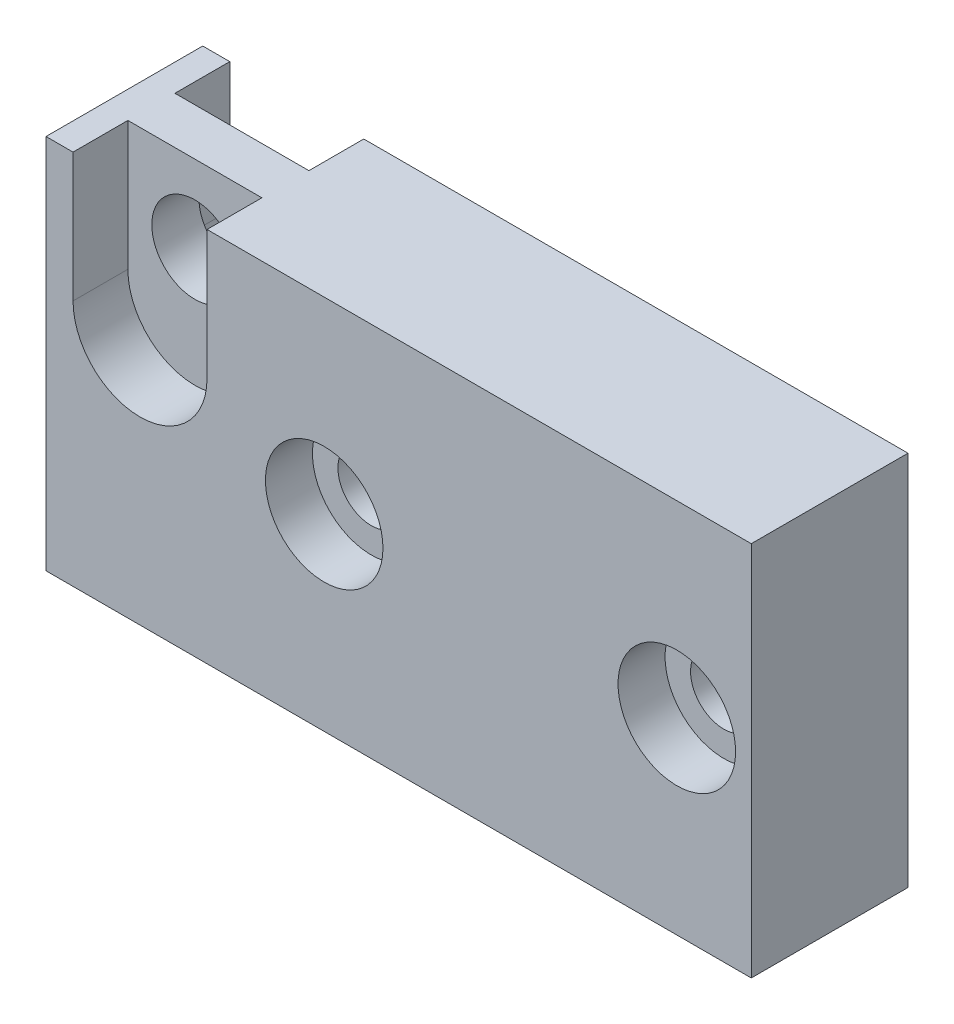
ISO-10303-21;
HEADER;
FILE_DESCRIPTION(('STEP AP214'),'2;1');
FILE_NAME('part.step','',(''),(''),'','','');
FILE_SCHEMA(('AUTOMOTIVE_DESIGN { 1 0 10303 214 1 1 1 1 }'));
ENDSEC;
DATA;
#1=APPLICATION_CONTEXT('core data for automotive mechanical design processes');
#2=APPLICATION_PROTOCOL_DEFINITION('international standard','automotive_design',2000,#1);
#3=PRODUCT_CONTEXT('',#1,'mechanical');
#4=PRODUCT('Part','Part','',(#3));
#5=PRODUCT_RELATED_PRODUCT_CATEGORY('part','',(#4));
#6=PRODUCT_DEFINITION_FORMATION('','',#4);
#7=PRODUCT_DEFINITION_CONTEXT('part definition',#1,'design');
#8=PRODUCT_DEFINITION('design','',#6,#7);
#9=PRODUCT_DEFINITION_SHAPE('','',#8);
#10=(LENGTH_UNIT() NAMED_UNIT(*) SI_UNIT(.MILLI.,.METRE.));
#11=(NAMED_UNIT(*) PLANE_ANGLE_UNIT() SI_UNIT($,.RADIAN.));
#12=(NAMED_UNIT(*) SI_UNIT($,.STERADIAN.) SOLID_ANGLE_UNIT());
#13=UNCERTAINTY_MEASURE_WITH_UNIT(LENGTH_MEASURE(1.E-05),#10,'distance_accuracy_value','');
#14=(GEOMETRIC_REPRESENTATION_CONTEXT(3) GLOBAL_UNCERTAINTY_ASSIGNED_CONTEXT((#13)) GLOBAL_UNIT_ASSIGNED_CONTEXT((#10,
#11,#12)) REPRESENTATION_CONTEXT('',''));
#15=CARTESIAN_POINT('',(0.,0.,0.));
#16=DIRECTION('',(0.,0.,1.));
#17=DIRECTION('',(1.,0.,0.));
#18=AXIS2_PLACEMENT_3D('',#15,#16,#17);
#19=CARTESIAN_POINT('',(0.,0.,-10.));
#20=DIRECTION('',(0.,0.,-1.));
#21=DIRECTION('',(-1.,0.,0.));
#22=AXIS2_PLACEMENT_3D('',#19,#20,#21);
#23=PLANE('',#22);
#24=CARTESIAN_POINT('',(-9.5,0.,-10.));
#25=DIRECTION('',(0.,0.,1.));
#26=DIRECTION('',(1.,0.,0.));
#27=AXIS2_PLACEMENT_3D('',#24,#25,#26);
#28=CIRCLE('',#27,7.5);
#29=CARTESIAN_POINT('',(-17.,0.,-10.));
#30=VERTEX_POINT('',#29);
#31=EDGE_CURVE('E157',#30,#30,#28,.T.);
#32=ORIENTED_EDGE('',*,*,#31,.T.);
#33=EDGE_LOOP('',(#32));
#34=FACE_BOUND('',#33,.T.);
#35=CARTESIAN_POINT('',(35.5,0.,-10.));
#36=DIRECTION('',(0.,0.,1.));
#37=DIRECTION('',(1.,0.,0.));
#38=AXIS2_PLACEMENT_3D('',#35,#36,#37);
#39=CIRCLE('',#38,7.5);
#40=CARTESIAN_POINT('',(28.,0.,-10.));
#41=VERTEX_POINT('',#40);
#42=EDGE_CURVE('E160',#41,#41,#39,.T.);
#43=ORIENTED_EDGE('',*,*,#42,.T.);
#44=EDGE_LOOP('',(#43));
#45=FACE_BOUND('',#44,.T.);
#46=DIRECTION('',(-1.,0.,0.));
#47=VECTOR('',#46,1.);
#48=CARTESIAN_POINT('',(-45.,24.,-10.));
#49=LINE('',#48,#47);
#50=CARTESIAN_POINT('',(-41.55,24.,-10.));
#51=VERTEX_POINT('',#50);
#52=CARTESIAN_POINT('',(-45.,24.,-10.));
#53=VERTEX_POINT('',#52);
#54=EDGE_CURVE('E241',#51,#53,#49,.T.);
#55=ORIENTED_EDGE('',*,*,#54,.F.);
#56=DIRECTION('',(0.,-1.,0.));
#57=VECTOR('',#56,1.);
#58=CARTESIAN_POINT('',(-41.55,0.,-10.));
#59=LINE('',#58,#57);
#60=CARTESIAN_POINT('',(-41.55,7.55,-10.));
#61=VERTEX_POINT('',#60);
#62=EDGE_CURVE('E478',#51,#61,#59,.T.);
#63=ORIENTED_EDGE('',*,*,#62,.T.);
#64=CARTESIAN_POINT('',(-33.,7.55,-10.));
#65=DIRECTION('',(0.,0.,1.));
#66=DIRECTION('',(1.,0.,0.));
#67=AXIS2_PLACEMENT_3D('',#64,#65,#66);
#68=CIRCLE('',#67,8.55);
#69=CARTESIAN_POINT('',(-24.45,7.55,-10.));
#70=VERTEX_POINT('',#69);
#71=EDGE_CURVE('E470',#61,#70,#68,.T.);
#72=ORIENTED_EDGE('',*,*,#71,.T.);
#73=DIRECTION('',(0.,1.,0.));
#74=VECTOR('',#73,1.);
#75=CARTESIAN_POINT('',(-24.45,0.,-10.));
#76=LINE('',#75,#74);
#77=CARTESIAN_POINT('',(-24.45,24.,-10.));
#78=VERTEX_POINT('',#77);
#79=EDGE_CURVE('E474',#70,#78,#76,.T.);
#80=ORIENTED_EDGE('',*,*,#79,.T.);
#81=CARTESIAN_POINT('',(45.,24.,-10.));
#82=VERTEX_POINT('',#81);
#83=EDGE_CURVE('E145',#82,#78,#49,.T.);
#84=ORIENTED_EDGE('',*,*,#83,.F.);
#85=DIRECTION('',(0.,1.,0.));
#86=VECTOR('',#85,1.);
#87=CARTESIAN_POINT('',(45.,24.,-10.));
#88=LINE('',#87,#86);
#89=CARTESIAN_POINT('',(45.,-24.,-10.));
#90=VERTEX_POINT('',#89);
#91=EDGE_CURVE('E238',#90,#82,#88,.T.);
#92=ORIENTED_EDGE('',*,*,#91,.F.);
#93=DIRECTION('',(1.,0.,0.));
#94=VECTOR('',#93,1.);
#95=CARTESIAN_POINT('',(45.,-24.,-10.));
#96=LINE('',#95,#94);
#97=CARTESIAN_POINT('',(-45.,-24.,-10.));
#98=VERTEX_POINT('',#97);
#99=EDGE_CURVE('E235',#98,#90,#96,.T.);
#100=ORIENTED_EDGE('',*,*,#99,.F.);
#101=DIRECTION('',(0.,-1.,0.));
#102=VECTOR('',#101,1.);
#103=CARTESIAN_POINT('',(-45.,-24.,-10.));
#104=LINE('',#103,#102);
#105=EDGE_CURVE('E232',#53,#98,#104,.T.);
#106=ORIENTED_EDGE('',*,*,#105,.F.);
#107=EDGE_LOOP('',(#55,#63,#72,#80,#84,#92,#100,#106));
#108=FACE_BOUND('',#107,.T.);
#109=ADVANCED_FACE('F35',(#34,#45,#108),#23,.T.);
#110=CARTESIAN_POINT('',(-33.,14.,-10.));
#111=DIRECTION('',(0.,0.,1.));
#112=DIRECTION('',(1.,0.,0.));
#113=AXIS2_PLACEMENT_3D('',#110,#111,#112);
#114=CYLINDRICAL_SURFACE('',#113,5.5);
#115=CARTESIAN_POINT('',(-33.,14.,3.));
#116=DIRECTION('',(0.,0.,1.));
#117=DIRECTION('',(1.,0.,0.));
#118=AXIS2_PLACEMENT_3D('',#115,#116,#117);
#119=CIRCLE('',#118,5.5);
#120=CARTESIAN_POINT('',(-27.5,14.,3.));
#121=VERTEX_POINT('',#120);
#122=EDGE_CURVE('E171',#121,#121,#119,.F.);
#123=ORIENTED_EDGE('',*,*,#122,.F.);
#124=EDGE_LOOP('',(#123));
#125=FACE_BOUND('',#124,.T.);
#126=CARTESIAN_POINT('',(-33.,14.,-3.));
#127=DIRECTION('',(0.,0.,1.));
#128=DIRECTION('',(1.,0.,0.));
#129=AXIS2_PLACEMENT_3D('',#126,#127,#128);
#130=CIRCLE('',#129,5.5);
#131=CARTESIAN_POINT('',(-27.5,14.,-3.));
#132=VERTEX_POINT('',#131);
#133=EDGE_CURVE('E468',#132,#132,#130,.F.);
#134=ORIENTED_EDGE('',*,*,#133,.T.);
#135=EDGE_LOOP('',(#134));
#136=FACE_BOUND('',#135,.T.);
#137=ADVANCED_FACE('F289',(#125,#136),#114,.F.);
#138=CARTESIAN_POINT('',(-45.,24.,-10.));
#139=DIRECTION('',(0.,1.,0.));
#140=DIRECTION('',(0.,0.,1.));
#141=AXIS2_PLACEMENT_3D('',#138,#139,#140);
#142=PLANE('',#141);
#143=DIRECTION('',(-1.,0.,0.));
#144=VECTOR('',#143,1.);
#145=CARTESIAN_POINT('',(0.,24.,-3.));
#146=LINE('',#145,#144);
#147=CARTESIAN_POINT('',(-24.45,24.,-3.));
#148=VERTEX_POINT('',#147);
#149=CARTESIAN_POINT('',(-41.55,24.,-3.));
#150=VERTEX_POINT('',#149);
#151=EDGE_CURVE('E135',#148,#150,#146,.T.);
#152=ORIENTED_EDGE('',*,*,#151,.T.);
#153=DIRECTION('',(0.,0.,-1.));
#154=VECTOR('',#153,1.);
#155=CARTESIAN_POINT('',(-41.55,24.,-3.));
#156=LINE('',#155,#154);
#157=EDGE_CURVE('E146',#150,#51,#156,.T.);
#158=ORIENTED_EDGE('',*,*,#157,.T.);
#159=ORIENTED_EDGE('',*,*,#54,.T.);
#160=DIRECTION('',(0.,0.,1.));
#161=VECTOR('',#160,1.);
#162=CARTESIAN_POINT('',(-45.,24.,-10.));
#163=LINE('',#162,#161);
#164=CARTESIAN_POINT('',(-45.,24.,10.));
#165=VERTEX_POINT('',#164);
#166=EDGE_CURVE('E11',#53,#165,#163,.T.);
#167=ORIENTED_EDGE('',*,*,#166,.T.);
#168=DIRECTION('',(-1.,0.,0.));
#169=VECTOR('',#168,1.);
#170=CARTESIAN_POINT('',(-45.,24.,10.));
#171=LINE('',#170,#169);
#172=CARTESIAN_POINT('',(-41.55,24.,10.));
#173=VERTEX_POINT('',#172);
#174=EDGE_CURVE('E228',#173,#165,#171,.T.);
#175=ORIENTED_EDGE('',*,*,#174,.F.);
#176=DIRECTION('',(0.,0.,1.));
#177=VECTOR('',#176,1.);
#178=CARTESIAN_POINT('',(-41.55,24.,3.));
#179=LINE('',#178,#177);
#180=CARTESIAN_POINT('',(-41.55,24.,3.));
#181=VERTEX_POINT('',#180);
#182=EDGE_CURVE('E193',#181,#173,#179,.T.);
#183=ORIENTED_EDGE('',*,*,#182,.F.);
#184=DIRECTION('',(-1.,0.,0.));
#185=VECTOR('',#184,1.);
#186=CARTESIAN_POINT('',(0.,24.,3.));
#187=LINE('',#186,#185);
#188=CARTESIAN_POINT('',(-24.45,24.,3.));
#189=VERTEX_POINT('',#188);
#190=EDGE_CURVE('E184',#189,#181,#187,.T.);
#191=ORIENTED_EDGE('',*,*,#190,.F.);
#192=DIRECTION('',(0.,0.,1.));
#193=VECTOR('',#192,1.);
#194=CARTESIAN_POINT('',(-24.45,24.,3.));
#195=LINE('',#194,#193);
#196=CARTESIAN_POINT('',(-24.45,24.,10.));
#197=VERTEX_POINT('',#196);
#198=EDGE_CURVE('E196',#189,#197,#195,.T.);
#199=ORIENTED_EDGE('',*,*,#198,.T.);
#200=CARTESIAN_POINT('',(45.,24.,10.));
#201=VERTEX_POINT('',#200);
#202=EDGE_CURVE('E229',#201,#197,#171,.T.);
#203=ORIENTED_EDGE('',*,*,#202,.F.);
#204=DIRECTION('',(0.,0.,1.));
#205=VECTOR('',#204,1.);
#206=CARTESIAN_POINT('',(45.,24.,-10.));
#207=LINE('',#206,#205);
#208=EDGE_CURVE('E44',#82,#201,#207,.T.);
#209=ORIENTED_EDGE('',*,*,#208,.F.);
#210=ORIENTED_EDGE('',*,*,#83,.T.);
#211=DIRECTION('',(0.,0.,-1.));
#212=VECTOR('',#211,1.);
#213=CARTESIAN_POINT('',(-24.45,24.,-3.));
#214=LINE('',#213,#212);
#215=EDGE_CURVE('E131',#148,#78,#214,.T.);
#216=ORIENTED_EDGE('',*,*,#215,.F.);
#217=EDGE_LOOP('',(#152,#158,#159,#167,#175,#183,#191,#199,#203,#209,#210,#216));
#218=FACE_BOUND('',#217,.T.);
#219=ADVANCED_FACE('F143',(#218),#142,.T.);
#220=CARTESIAN_POINT('',(-9.5,0.,-10.));
#221=DIRECTION('',(0.,0.,1.));
#222=DIRECTION('',(1.,0.,0.));
#223=AXIS2_PLACEMENT_3D('',#220,#221,#222);
#224=CYLINDRICAL_SURFACE('',#223,4.25);
#225=CARTESIAN_POINT('',(-9.5,0.,4.));
#226=DIRECTION('',(0.,0.,1.));
#227=DIRECTION('',(1.,0.,0.));
#228=AXIS2_PLACEMENT_3D('',#225,#226,#227);
#229=CIRCLE('',#228,4.25);
#230=CARTESIAN_POINT('',(-5.25,0.,4.));
#231=VERTEX_POINT('',#230);
#232=EDGE_CURVE('E202',#231,#231,#229,.F.);
#233=ORIENTED_EDGE('',*,*,#232,.F.);
#234=EDGE_LOOP('',(#233));
#235=FACE_BOUND('',#234,.T.);
#236=CARTESIAN_POINT('',(-9.5,0.,-4.));
#237=DIRECTION('',(0.,0.,1.));
#238=DIRECTION('',(1.,0.,0.));
#239=AXIS2_PLACEMENT_3D('',#236,#237,#238);
#240=CIRCLE('',#239,4.25);
#241=CARTESIAN_POINT('',(-5.25,0.,-4.));
#242=VERTEX_POINT('',#241);
#243=EDGE_CURVE('E153',#242,#242,#240,.F.);
#244=ORIENTED_EDGE('',*,*,#243,.T.);
#245=EDGE_LOOP('',(#244));
#246=FACE_BOUND('',#245,.T.);
#247=ADVANCED_FACE('F303',(#235,#246),#224,.F.);
#248=CARTESIAN_POINT('',(35.5,0.,-10.));
#249=DIRECTION('',(0.,0.,1.));
#250=DIRECTION('',(1.,0.,0.));
#251=AXIS2_PLACEMENT_3D('',#248,#249,#250);
#252=CYLINDRICAL_SURFACE('',#251,4.25);
#253=CARTESIAN_POINT('',(35.5,0.,4.));
#254=DIRECTION('',(0.,0.,1.));
#255=DIRECTION('',(1.,0.,0.));
#256=AXIS2_PLACEMENT_3D('',#253,#254,#255);
#257=CIRCLE('',#256,4.25);
#258=CARTESIAN_POINT('',(39.75,0.,4.));
#259=VERTEX_POINT('',#258);
#260=EDGE_CURVE('E211',#259,#259,#257,.F.);
#261=ORIENTED_EDGE('',*,*,#260,.F.);
#262=EDGE_LOOP('',(#261));
#263=FACE_BOUND('',#262,.T.);
#264=CARTESIAN_POINT('',(35.5,0.,-4.));
#265=DIRECTION('',(0.,0.,1.));
#266=DIRECTION('',(1.,0.,0.));
#267=AXIS2_PLACEMENT_3D('',#264,#265,#266);
#268=CIRCLE('',#267,4.25);
#269=CARTESIAN_POINT('',(39.75,0.,-4.));
#270=VERTEX_POINT('',#269);
#271=EDGE_CURVE('E163',#270,#270,#268,.F.);
#272=ORIENTED_EDGE('',*,*,#271,.T.);
#273=EDGE_LOOP('',(#272));
#274=FACE_BOUND('',#273,.T.);
#275=ADVANCED_FACE('F333',(#263,#274),#252,.F.);
#276=CARTESIAN_POINT('',(-45.,-24.,-10.));
#277=DIRECTION('',(-1.,0.,0.));
#278=DIRECTION('',(0.,0.,1.));
#279=AXIS2_PLACEMENT_3D('',#276,#277,#278);
#280=PLANE('',#279);
#281=DIRECTION('',(0.,0.,1.));
#282=VECTOR('',#281,1.);
#283=CARTESIAN_POINT('',(-45.,-24.,-10.));
#284=LINE('',#283,#282);
#285=CARTESIAN_POINT('',(-45.,-24.,10.));
#286=VERTEX_POINT('',#285);
#287=EDGE_CURVE('E39',#98,#286,#284,.T.);
#288=ORIENTED_EDGE('',*,*,#287,.T.);
#289=DIRECTION('',(0.,-1.,0.));
#290=VECTOR('',#289,1.);
#291=CARTESIAN_POINT('',(-45.,-24.,10.));
#292=LINE('',#291,#290);
#293=EDGE_CURVE('E217',#165,#286,#292,.T.);
#294=ORIENTED_EDGE('',*,*,#293,.F.);
#295=ORIENTED_EDGE('',*,*,#166,.F.);
#296=ORIENTED_EDGE('',*,*,#105,.T.);
#297=EDGE_LOOP('',(#288,#294,#295,#296));
#298=FACE_BOUND('',#297,.T.);
#299=ADVANCED_FACE('F37',(#298),#280,.T.);
#300=CARTESIAN_POINT('',(45.,24.,-10.));
#301=DIRECTION('',(1.,0.,0.));
#302=DIRECTION('',(0.,0.,-1.));
#303=AXIS2_PLACEMENT_3D('',#300,#301,#302);
#304=PLANE('',#303);
#305=ORIENTED_EDGE('',*,*,#208,.T.);
#306=DIRECTION('',(0.,1.,0.));
#307=VECTOR('',#306,1.);
#308=CARTESIAN_POINT('',(45.,24.,10.));
#309=LINE('',#308,#307);
#310=CARTESIAN_POINT('',(45.,-24.,10.));
#311=VERTEX_POINT('',#310);
#312=EDGE_CURVE('E225',#311,#201,#309,.T.);
#313=ORIENTED_EDGE('',*,*,#312,.F.);
#314=DIRECTION('',(0.,0.,1.));
#315=VECTOR('',#314,1.);
#316=CARTESIAN_POINT('',(45.,-24.,-10.));
#317=LINE('',#316,#315);
#318=EDGE_CURVE('E243',#90,#311,#317,.T.);
#319=ORIENTED_EDGE('',*,*,#318,.F.);
#320=ORIENTED_EDGE('',*,*,#91,.T.);
#321=EDGE_LOOP('',(#305,#313,#319,#320));
#322=FACE_BOUND('',#321,.T.);
#323=ADVANCED_FACE('F263',(#322),#304,.T.);
#324=CARTESIAN_POINT('',(45.,-24.,-10.));
#325=DIRECTION('',(0.,-1.,0.));
#326=DIRECTION('',(0.,0.,-1.));
#327=AXIS2_PLACEMENT_3D('',#324,#325,#326);
#328=PLANE('',#327);
#329=ORIENTED_EDGE('',*,*,#318,.T.);
#330=DIRECTION('',(1.,0.,0.));
#331=VECTOR('',#330,1.);
#332=CARTESIAN_POINT('',(45.,-24.,10.));
#333=LINE('',#332,#331);
#334=EDGE_CURVE('E222',#286,#311,#333,.T.);
#335=ORIENTED_EDGE('',*,*,#334,.F.);
#336=ORIENTED_EDGE('',*,*,#287,.F.);
#337=ORIENTED_EDGE('',*,*,#99,.T.);
#338=EDGE_LOOP('',(#329,#335,#336,#337));
#339=FACE_BOUND('',#338,.T.);
#340=ADVANCED_FACE('F251',(#339),#328,.T.);
#341=CARTESIAN_POINT('',(0.,0.,10.));
#342=DIRECTION('',(0.,0.,-1.));
#343=DIRECTION('',(-1.,0.,0.));
#344=AXIS2_PLACEMENT_3D('',#341,#342,#343);
#345=PLANE('',#344);
#346=CARTESIAN_POINT('',(-9.5,0.,10.));
#347=DIRECTION('',(0.,0.,1.));
#348=DIRECTION('',(1.,0.,0.));
#349=AXIS2_PLACEMENT_3D('',#346,#347,#348);
#350=CIRCLE('',#349,7.5);
#351=CARTESIAN_POINT('',(-2.,0.,10.));
#352=VERTEX_POINT('',#351);
#353=EDGE_CURVE('E195',#352,#352,#350,.T.);
#354=ORIENTED_EDGE('',*,*,#353,.F.);
#355=EDGE_LOOP('',(#354));
#356=FACE_BOUND('',#355,.T.);
#357=CARTESIAN_POINT('',(35.5,0.,10.));
#358=DIRECTION('',(0.,0.,1.));
#359=DIRECTION('',(1.,0.,0.));
#360=AXIS2_PLACEMENT_3D('',#357,#358,#359);
#361=CIRCLE('',#360,7.5);
#362=CARTESIAN_POINT('',(43.,0.,10.));
#363=VERTEX_POINT('',#362);
#364=EDGE_CURVE('E208',#363,#363,#361,.T.);
#365=ORIENTED_EDGE('',*,*,#364,.F.);
#366=EDGE_LOOP('',(#365));
#367=FACE_BOUND('',#366,.T.);
#368=CARTESIAN_POINT('',(-33.,7.55,10.));
#369=DIRECTION('',(0.,0.,1.));
#370=DIRECTION('',(1.,0.,0.));
#371=AXIS2_PLACEMENT_3D('',#368,#369,#370);
#372=CIRCLE('',#371,8.55);
#373=CARTESIAN_POINT('',(-41.55,7.55,10.));
#374=VERTEX_POINT('',#373);
#375=CARTESIAN_POINT('',(-24.45,7.55,10.));
#376=VERTEX_POINT('',#375);
#377=EDGE_CURVE('E189',#374,#376,#372,.T.);
#378=ORIENTED_EDGE('',*,*,#377,.F.);
#379=DIRECTION('',(0.,-1.,0.));
#380=VECTOR('',#379,1.);
#381=CARTESIAN_POINT('',(-41.55,0.,10.));
#382=LINE('',#381,#380);
#383=EDGE_CURVE('E60',#173,#374,#382,.T.);
#384=ORIENTED_EDGE('',*,*,#383,.F.);
#385=ORIENTED_EDGE('',*,*,#174,.T.);
#386=ORIENTED_EDGE('',*,*,#293,.T.);
#387=ORIENTED_EDGE('',*,*,#334,.T.);
#388=ORIENTED_EDGE('',*,*,#312,.T.);
#389=ORIENTED_EDGE('',*,*,#202,.T.);
#390=DIRECTION('',(0.,1.,0.));
#391=VECTOR('',#390,1.);
#392=CARTESIAN_POINT('',(-24.45,0.,10.));
#393=LINE('',#392,#391);
#394=EDGE_CURVE('E175',#376,#197,#393,.T.);
#395=ORIENTED_EDGE('',*,*,#394,.F.);
#396=EDGE_LOOP('',(#378,#384,#385,#386,#387,#388,#389,#395));
#397=FACE_BOUND('',#396,.T.);
#398=ADVANCED_FACE('F255',(#356,#367,#397),#345,.F.);
#399=CARTESIAN_POINT('',(35.5,0.,4.));
#400=DIRECTION('',(0.,0.,1.));
#401=DIRECTION('',(1.,0.,0.));
#402=AXIS2_PLACEMENT_3D('',#399,#400,#401);
#403=CYLINDRICAL_SURFACE('',#402,7.5);
#404=CARTESIAN_POINT('',(35.5,0.,4.));
#405=DIRECTION('',(0.,0.,1.));
#406=DIRECTION('',(1.,0.,0.));
#407=AXIS2_PLACEMENT_3D('',#404,#405,#406);
#408=CIRCLE('',#407,7.5);
#409=CARTESIAN_POINT('',(43.,0.,4.));
#410=VERTEX_POINT('',#409);
#411=EDGE_CURVE('E214',#410,#410,#408,.T.);
#412=CARTESIAN_POINT('',(43.,0.,4.));
#413=CARTESIAN_POINT('',(43.,0.,4.0625));
#414=CARTESIAN_POINT('',(43.,0.,4.125));
#415=CARTESIAN_POINT('',(43.,0.,4.25));
#416=CARTESIAN_POINT('',(43.,0.,4.3125));
#417=CARTESIAN_POINT('',(43.,0.,4.4375));
#418=CARTESIAN_POINT('',(43.,0.,4.5));
#419=CARTESIAN_POINT('',(43.,0.,4.625));
#420=CARTESIAN_POINT('',(43.,0.,4.6875));
#421=CARTESIAN_POINT('',(43.,0.,4.8125));
#422=CARTESIAN_POINT('',(43.,0.,4.875));
#423=CARTESIAN_POINT('',(43.,0.,5.));
#424=CARTESIAN_POINT('',(43.,0.,5.0625));
#425=CARTESIAN_POINT('',(43.,0.,5.1875));
#426=CARTESIAN_POINT('',(43.,0.,5.25));
#427=CARTESIAN_POINT('',(43.,0.,5.375));
#428=CARTESIAN_POINT('',(43.,0.,5.4375));
#429=CARTESIAN_POINT('',(43.,0.,5.5625));
#430=CARTESIAN_POINT('',(43.,0.,5.625));
#431=CARTESIAN_POINT('',(43.,0.,5.75));
#432=CARTESIAN_POINT('',(43.,0.,5.8125));
#433=CARTESIAN_POINT('',(43.,0.,5.9375));
#434=CARTESIAN_POINT('',(43.,0.,6.));
#435=CARTESIAN_POINT('',(43.,0.,6.125));
#436=CARTESIAN_POINT('',(43.,0.,6.1875));
#437=CARTESIAN_POINT('',(43.,0.,6.3125));
#438=CARTESIAN_POINT('',(43.,0.,6.375));
#439=CARTESIAN_POINT('',(43.,0.,6.5));
#440=CARTESIAN_POINT('',(43.,0.,6.5625));
#441=CARTESIAN_POINT('',(43.,0.,6.6875));
#442=CARTESIAN_POINT('',(43.,0.,6.75));
#443=CARTESIAN_POINT('',(43.,0.,6.875));
#444=CARTESIAN_POINT('',(43.,0.,6.9375));
#445=CARTESIAN_POINT('',(43.,0.,7.0625));
#446=CARTESIAN_POINT('',(43.,0.,7.125));
#447=CARTESIAN_POINT('',(43.,0.,7.25));
#448=CARTESIAN_POINT('',(43.,0.,7.3125));
#449=CARTESIAN_POINT('',(43.,0.,7.4375));
#450=CARTESIAN_POINT('',(43.,0.,7.5));
#451=CARTESIAN_POINT('',(43.,0.,7.625));
#452=CARTESIAN_POINT('',(43.,0.,7.6875));
#453=CARTESIAN_POINT('',(43.,0.,7.8125));
#454=CARTESIAN_POINT('',(43.,0.,7.875));
#455=CARTESIAN_POINT('',(43.,0.,8.));
#456=CARTESIAN_POINT('',(43.,0.,8.0625));
#457=CARTESIAN_POINT('',(43.,0.,8.1875));
#458=CARTESIAN_POINT('',(43.,0.,8.25));
#459=CARTESIAN_POINT('',(43.,0.,8.375));
#460=CARTESIAN_POINT('',(43.,0.,8.4375));
#461=CARTESIAN_POINT('',(43.,0.,8.5625));
#462=CARTESIAN_POINT('',(43.,0.,8.625));
#463=CARTESIAN_POINT('',(43.,0.,8.75));
#464=CARTESIAN_POINT('',(43.,0.,8.8125));
#465=CARTESIAN_POINT('',(43.,0.,8.9375));
#466=CARTESIAN_POINT('',(43.,0.,9.));
#467=CARTESIAN_POINT('',(43.,0.,9.125));
#468=CARTESIAN_POINT('',(43.,0.,9.1875));
#469=CARTESIAN_POINT('',(43.,0.,9.3125));
#470=CARTESIAN_POINT('',(43.,0.,9.375));
#471=CARTESIAN_POINT('',(43.,0.,9.5));
#472=CARTESIAN_POINT('',(43.,0.,9.5625));
#473=CARTESIAN_POINT('',(43.,0.,9.6875));
#474=CARTESIAN_POINT('',(43.,0.,9.75));
#475=CARTESIAN_POINT('',(43.,0.,9.875));
#476=CARTESIAN_POINT('',(43.,0.,9.9375));
#477=CARTESIAN_POINT('',(43.,0.,10.));
#478=B_SPLINE_CURVE_WITH_KNOTS('',3,(#412,#413,#414,#415,#416,#417,#418,#419,#420,#421,#422,
#423,#424,#425,#426,#427,#428,#429,#430,#431,#432,#433,#434,#435,#436,#437,#438,#439,#440,#441,
#442,#443,#444,#445,#446,#447,#448,#449,#450,#451,#452,#453,#454,#455,#456,#457,#458,#459,#460,
#461,#462,#463,#464,#465,#466,#467,#468,#469,#470,#471,#472,#473,#474,#475,#476,#477),
.UNSPECIFIED.,.F.,.F.,(4,2,2,2,2,2,2,2,2,2,2,2,2,2,2,2,2,2,2,2,2,2,2,2,2,2,2,2,2,2,2,2,4),(0.,
0.1875,0.375,0.5625,0.750000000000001,0.937500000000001,1.125,1.3125,1.5,1.6875,1.875,2.0625,
2.25,2.4375,2.625,2.8125,3.,3.1875,3.375,3.5625,3.75,3.9375,4.125,4.3125,4.5,4.6875,4.875,
5.0625,5.25,5.4375,5.625,5.8125,6.),.UNSPECIFIED.);
#479=EDGE_CURVE('BSEAM309',#410,#363,#478,.T.);
#480=ORIENTED_EDGE('',*,*,#411,.F.);
#481=ORIENTED_EDGE('',*,*,#364,.T.);
#482=ORIENTED_EDGE('',*,*,#479,.T.);
#483=ORIENTED_EDGE('',*,*,#479,.F.);
#484=EDGE_LOOP('',(#480,#482,#481,#483));
#485=FACE_BOUND('',#484,.T.);
#486=ADVANCED_FACE('F309',(#485),#403,.F.);
#487=CARTESIAN_POINT('',(0.,0.,4.));
#488=DIRECTION('',(0.,0.,1.));
#489=DIRECTION('',(1.,0.,0.));
#490=AXIS2_PLACEMENT_3D('',#487,#488,#489);
#491=PLANE('',#490);
#492=ORIENTED_EDGE('',*,*,#260,.T.);
#493=EDGE_LOOP('',(#492));
#494=FACE_BOUND('',#493,.T.);
#495=ORIENTED_EDGE('',*,*,#411,.T.);
#496=EDGE_LOOP('',(#495));
#497=FACE_BOUND('',#496,.T.);
#498=ADVANCED_FACE('F314',(#494,#497),#491,.T.);
#499=CARTESIAN_POINT('',(-9.5,0.,4.));
#500=DIRECTION('',(0.,0.,1.));
#501=DIRECTION('',(1.,0.,0.));
#502=AXIS2_PLACEMENT_3D('',#499,#500,#501);
#503=CYLINDRICAL_SURFACE('',#502,7.5);
#504=CARTESIAN_POINT('',(-9.5,0.,4.));
#505=DIRECTION('',(0.,0.,1.));
#506=DIRECTION('',(1.,0.,0.));
#507=AXIS2_PLACEMENT_3D('',#504,#505,#506);
#508=CIRCLE('',#507,7.5);
#509=CARTESIAN_POINT('',(-2.,0.,4.));
#510=VERTEX_POINT('',#509);
#511=EDGE_CURVE('E205',#510,#510,#508,.T.);
#512=CARTESIAN_POINT('',(-2.,0.,4.));
#513=CARTESIAN_POINT('',(-2.,0.,4.0625));
#514=CARTESIAN_POINT('',(-2.,0.,4.125));
#515=CARTESIAN_POINT('',(-2.,0.,4.25));
#516=CARTESIAN_POINT('',(-2.,0.,4.3125));
#517=CARTESIAN_POINT('',(-2.,0.,4.4375));
#518=CARTESIAN_POINT('',(-2.,0.,4.5));
#519=CARTESIAN_POINT('',(-2.,0.,4.625));
#520=CARTESIAN_POINT('',(-2.,0.,4.6875));
#521=CARTESIAN_POINT('',(-2.,0.,4.8125));
#522=CARTESIAN_POINT('',(-2.,0.,4.875));
#523=CARTESIAN_POINT('',(-2.,0.,5.));
#524=CARTESIAN_POINT('',(-2.,0.,5.0625));
#525=CARTESIAN_POINT('',(-2.,0.,5.1875));
#526=CARTESIAN_POINT('',(-2.,0.,5.25));
#527=CARTESIAN_POINT('',(-2.,0.,5.375));
#528=CARTESIAN_POINT('',(-2.,0.,5.4375));
#529=CARTESIAN_POINT('',(-2.,0.,5.5625));
#530=CARTESIAN_POINT('',(-2.,0.,5.625));
#531=CARTESIAN_POINT('',(-2.,0.,5.75));
#532=CARTESIAN_POINT('',(-2.,0.,5.8125));
#533=CARTESIAN_POINT('',(-2.,0.,5.9375));
#534=CARTESIAN_POINT('',(-2.,0.,6.));
#535=CARTESIAN_POINT('',(-2.,0.,6.125));
#536=CARTESIAN_POINT('',(-2.,0.,6.1875));
#537=CARTESIAN_POINT('',(-2.,0.,6.3125));
#538=CARTESIAN_POINT('',(-2.,0.,6.375));
#539=CARTESIAN_POINT('',(-2.,0.,6.5));
#540=CARTESIAN_POINT('',(-2.,0.,6.5625));
#541=CARTESIAN_POINT('',(-2.,0.,6.6875));
#542=CARTESIAN_POINT('',(-2.,0.,6.75));
#543=CARTESIAN_POINT('',(-2.,0.,6.875));
#544=CARTESIAN_POINT('',(-2.,0.,6.9375));
#545=CARTESIAN_POINT('',(-2.,0.,7.0625));
#546=CARTESIAN_POINT('',(-2.,0.,7.125));
#547=CARTESIAN_POINT('',(-2.,0.,7.25));
#548=CARTESIAN_POINT('',(-2.,0.,7.3125));
#549=CARTESIAN_POINT('',(-2.,0.,7.4375));
#550=CARTESIAN_POINT('',(-2.,0.,7.5));
#551=CARTESIAN_POINT('',(-2.,0.,7.625));
#552=CARTESIAN_POINT('',(-2.,0.,7.6875));
#553=CARTESIAN_POINT('',(-2.,0.,7.8125));
#554=CARTESIAN_POINT('',(-2.,0.,7.875));
#555=CARTESIAN_POINT('',(-2.,0.,8.));
#556=CARTESIAN_POINT('',(-2.,0.,8.0625));
#557=CARTESIAN_POINT('',(-2.,0.,8.1875));
#558=CARTESIAN_POINT('',(-2.,0.,8.25));
#559=CARTESIAN_POINT('',(-2.,0.,8.375));
#560=CARTESIAN_POINT('',(-2.,0.,8.4375));
#561=CARTESIAN_POINT('',(-2.,0.,8.5625));
#562=CARTESIAN_POINT('',(-2.,0.,8.625));
#563=CARTESIAN_POINT('',(-2.,0.,8.75));
#564=CARTESIAN_POINT('',(-2.,0.,8.8125));
#565=CARTESIAN_POINT('',(-2.,0.,8.9375));
#566=CARTESIAN_POINT('',(-2.,0.,9.));
#567=CARTESIAN_POINT('',(-2.,0.,9.125));
#568=CARTESIAN_POINT('',(-2.,0.,9.1875));
#569=CARTESIAN_POINT('',(-2.,0.,9.3125));
#570=CARTESIAN_POINT('',(-2.,0.,9.375));
#571=CARTESIAN_POINT('',(-2.,0.,9.5));
#572=CARTESIAN_POINT('',(-2.,0.,9.5625));
#573=CARTESIAN_POINT('',(-2.,0.,9.6875));
#574=CARTESIAN_POINT('',(-2.,0.,9.75));
#575=CARTESIAN_POINT('',(-2.,0.,9.875));
#576=CARTESIAN_POINT('',(-2.,0.,9.9375));
#577=CARTESIAN_POINT('',(-2.,0.,10.));
#578=B_SPLINE_CURVE_WITH_KNOTS('',3,(#512,#513,#514,#515,#516,#517,#518,#519,#520,#521,#522,
#523,#524,#525,#526,#527,#528,#529,#530,#531,#532,#533,#534,#535,#536,#537,#538,#539,#540,#541,
#542,#543,#544,#545,#546,#547,#548,#549,#550,#551,#552,#553,#554,#555,#556,#557,#558,#559,#560,
#561,#562,#563,#564,#565,#566,#567,#568,#569,#570,#571,#572,#573,#574,#575,#576,#577),
.UNSPECIFIED.,.F.,.F.,(4,2,2,2,2,2,2,2,2,2,2,2,2,2,2,2,2,2,2,2,2,2,2,2,2,2,2,2,2,2,2,2,4),(0.,
0.1875,0.375,0.5625,0.750000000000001,0.937500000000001,1.125,1.3125,1.5,1.6875,1.875,2.0625,
2.25,2.4375,2.625,2.8125,3.,3.1875,3.375,3.5625,3.75,3.9375,4.125,4.3125,4.5,4.6875,4.875,
5.0625,5.25,5.4375,5.625,5.8125,6.),.UNSPECIFIED.);
#579=EDGE_CURVE('BSEAM284',#510,#352,#578,.T.);
#580=ORIENTED_EDGE('',*,*,#511,.F.);
#581=ORIENTED_EDGE('',*,*,#353,.T.);
#582=ORIENTED_EDGE('',*,*,#579,.T.);
#583=ORIENTED_EDGE('',*,*,#579,.F.);
#584=EDGE_LOOP('',(#580,#582,#581,#583));
#585=FACE_BOUND('',#584,.T.);
#586=ADVANCED_FACE('F284',(#585),#503,.F.);
#587=CARTESIAN_POINT('',(0.,0.,4.));
#588=DIRECTION('',(0.,0.,1.));
#589=DIRECTION('',(1.,0.,0.));
#590=AXIS2_PLACEMENT_3D('',#587,#588,#589);
#591=PLANE('',#590);
#592=ORIENTED_EDGE('',*,*,#232,.T.);
#593=EDGE_LOOP('',(#592));
#594=FACE_BOUND('',#593,.T.);
#595=ORIENTED_EDGE('',*,*,#511,.T.);
#596=EDGE_LOOP('',(#595));
#597=FACE_BOUND('',#596,.T.);
#598=ADVANCED_FACE('F277',(#594,#597),#591,.T.);
#599=CARTESIAN_POINT('',(-41.55,0.,3.));
#600=DIRECTION('',(-1.,0.,0.));
#601=DIRECTION('',(0.,-1.,0.));
#602=AXIS2_PLACEMENT_3D('',#599,#600,#601);
#603=PLANE('',#602);
#604=ORIENTED_EDGE('',*,*,#383,.T.);
#605=DIRECTION('',(0.,0.,1.));
#606=VECTOR('',#605,1.);
#607=CARTESIAN_POINT('',(-41.55,7.55,3.));
#608=LINE('',#607,#606);
#609=CARTESIAN_POINT('',(-41.55,7.55,3.));
#610=VERTEX_POINT('',#609);
#611=EDGE_CURVE('E187',#610,#374,#608,.T.);
#612=ORIENTED_EDGE('',*,*,#611,.F.);
#613=DIRECTION('',(0.,-1.,0.));
#614=VECTOR('',#613,1.);
#615=CARTESIAN_POINT('',(-41.55,0.,3.));
#616=LINE('',#615,#614);
#617=EDGE_CURVE('E174',#181,#610,#616,.T.);
#618=ORIENTED_EDGE('',*,*,#617,.F.);
#619=ORIENTED_EDGE('',*,*,#182,.T.);
#620=EDGE_LOOP('',(#604,#612,#618,#619));
#621=FACE_BOUND('',#620,.T.);
#622=ADVANCED_FACE('F275',(#621),#603,.F.);
#623=CARTESIAN_POINT('',(-24.45,0.,3.));
#624=DIRECTION('',(1.,0.,0.));
#625=DIRECTION('',(0.,0.,-1.));
#626=AXIS2_PLACEMENT_3D('',#623,#624,#625);
#627=PLANE('',#626);
#628=ORIENTED_EDGE('',*,*,#394,.T.);
#629=ORIENTED_EDGE('',*,*,#198,.F.);
#630=DIRECTION('',(0.,1.,0.));
#631=VECTOR('',#630,1.);
#632=CARTESIAN_POINT('',(-24.45,0.,3.));
#633=LINE('',#632,#631);
#634=CARTESIAN_POINT('',(-24.45,7.55,3.));
#635=VERTEX_POINT('',#634);
#636=EDGE_CURVE('E181',#635,#189,#633,.T.);
#637=ORIENTED_EDGE('',*,*,#636,.F.);
#638=DIRECTION('',(0.,0.,1.));
#639=VECTOR('',#638,1.);
#640=CARTESIAN_POINT('',(-24.45,7.55,3.));
#641=LINE('',#640,#639);
#642=EDGE_CURVE('E199',#635,#376,#641,.T.);
#643=ORIENTED_EDGE('',*,*,#642,.T.);
#644=EDGE_LOOP('',(#628,#629,#637,#643));
#645=FACE_BOUND('',#644,.T.);
#646=ADVANCED_FACE('F269',(#645),#627,.F.);
#647=CARTESIAN_POINT('',(-33.,7.55,3.));
#648=DIRECTION('',(0.,0.,1.));
#649=DIRECTION('',(1.,0.,0.));
#650=AXIS2_PLACEMENT_3D('',#647,#648,#649);
#651=CYLINDRICAL_SURFACE('',#650,8.55);
#652=ORIENTED_EDGE('',*,*,#377,.T.);
#653=ORIENTED_EDGE('',*,*,#642,.F.);
#654=CARTESIAN_POINT('',(-33.,7.55,3.));
#655=DIRECTION('',(0.,0.,1.));
#656=DIRECTION('',(1.,0.,0.));
#657=AXIS2_PLACEMENT_3D('',#654,#655,#656);
#658=CIRCLE('',#657,8.55);
#659=EDGE_CURVE('E178',#610,#635,#658,.T.);
#660=ORIENTED_EDGE('',*,*,#659,.F.);
#661=ORIENTED_EDGE('',*,*,#611,.T.);
#662=EDGE_LOOP('',(#652,#653,#660,#661));
#663=FACE_BOUND('',#662,.T.);
#664=ADVANCED_FACE('F274',(#663),#651,.F.);
#665=CARTESIAN_POINT('',(0.,0.,3.));
#666=DIRECTION('',(0.,0.,1.));
#667=DIRECTION('',(1.,0.,0.));
#668=AXIS2_PLACEMENT_3D('',#665,#666,#667);
#669=PLANE('',#668);
#670=ORIENTED_EDGE('',*,*,#122,.T.);
#671=EDGE_LOOP('',(#670));
#672=FACE_BOUND('',#671,.T.);
#673=ORIENTED_EDGE('',*,*,#617,.T.);
#674=ORIENTED_EDGE('',*,*,#659,.T.);
#675=ORIENTED_EDGE('',*,*,#636,.T.);
#676=ORIENTED_EDGE('',*,*,#190,.T.);
#677=EDGE_LOOP('',(#673,#674,#675,#676));
#678=FACE_BOUND('',#677,.T.);
#679=ADVANCED_FACE('F271',(#672,#678),#669,.T.);
#680=CARTESIAN_POINT('',(35.5,0.,-4.));
#681=DIRECTION('',(0.,0.,-1.));
#682=DIRECTION('',(-1.,0.,0.));
#683=AXIS2_PLACEMENT_3D('',#680,#681,#682);
#684=CYLINDRICAL_SURFACE('',#683,7.5);
#685=CARTESIAN_POINT('',(35.5,0.,-4.));
#686=DIRECTION('',(0.,0.,1.));
#687=DIRECTION('',(1.,0.,0.));
#688=AXIS2_PLACEMENT_3D('',#685,#686,#687);
#689=CIRCLE('',#688,7.5);
#690=CARTESIAN_POINT('',(28.,0.,-4.));
#691=VERTEX_POINT('',#690);
#692=EDGE_CURVE('E166',#691,#691,#689,.T.);
#693=CARTESIAN_POINT('',(28.,0.,-4.));
#694=CARTESIAN_POINT('',(28.,0.,-4.0625));
#695=CARTESIAN_POINT('',(28.,0.,-4.125));
#696=CARTESIAN_POINT('',(28.,0.,-4.25));
#697=CARTESIAN_POINT('',(28.,0.,-4.3125));
#698=CARTESIAN_POINT('',(28.,0.,-4.4375));
#699=CARTESIAN_POINT('',(28.,0.,-4.5));
#700=CARTESIAN_POINT('',(28.,0.,-4.625));
#701=CARTESIAN_POINT('',(28.,0.,-4.6875));
#702=CARTESIAN_POINT('',(28.,0.,-4.8125));
#703=CARTESIAN_POINT('',(28.,0.,-4.875));
#704=CARTESIAN_POINT('',(28.,0.,-5.));
#705=CARTESIAN_POINT('',(28.,0.,-5.0625));
#706=CARTESIAN_POINT('',(28.,0.,-5.1875));
#707=CARTESIAN_POINT('',(28.,0.,-5.25));
#708=CARTESIAN_POINT('',(28.,0.,-5.375));
#709=CARTESIAN_POINT('',(28.,0.,-5.4375));
#710=CARTESIAN_POINT('',(28.,0.,-5.5625));
#711=CARTESIAN_POINT('',(28.,0.,-5.625));
#712=CARTESIAN_POINT('',(28.,0.,-5.75));
#713=CARTESIAN_POINT('',(28.,0.,-5.8125));
#714=CARTESIAN_POINT('',(28.,0.,-5.9375));
#715=CARTESIAN_POINT('',(28.,0.,-6.));
#716=CARTESIAN_POINT('',(28.,0.,-6.125));
#717=CARTESIAN_POINT('',(28.,0.,-6.1875));
#718=CARTESIAN_POINT('',(28.,0.,-6.3125));
#719=CARTESIAN_POINT('',(28.,0.,-6.375));
#720=CARTESIAN_POINT('',(28.,0.,-6.5));
#721=CARTESIAN_POINT('',(28.,0.,-6.5625));
#722=CARTESIAN_POINT('',(28.,0.,-6.6875));
#723=CARTESIAN_POINT('',(28.,0.,-6.75));
#724=CARTESIAN_POINT('',(28.,0.,-6.875));
#725=CARTESIAN_POINT('',(28.,0.,-6.9375));
#726=CARTESIAN_POINT('',(28.,0.,-7.0625));
#727=CARTESIAN_POINT('',(28.,0.,-7.125));
#728=CARTESIAN_POINT('',(28.,0.,-7.25));
#729=CARTESIAN_POINT('',(28.,0.,-7.3125));
#730=CARTESIAN_POINT('',(28.,0.,-7.4375));
#731=CARTESIAN_POINT('',(28.,0.,-7.5));
#732=CARTESIAN_POINT('',(28.,0.,-7.625));
#733=CARTESIAN_POINT('',(28.,0.,-7.6875));
#734=CARTESIAN_POINT('',(28.,0.,-7.8125));
#735=CARTESIAN_POINT('',(28.,0.,-7.875));
#736=CARTESIAN_POINT('',(28.,0.,-8.));
#737=CARTESIAN_POINT('',(28.,0.,-8.0625));
#738=CARTESIAN_POINT('',(28.,0.,-8.1875));
#739=CARTESIAN_POINT('',(28.,0.,-8.25));
#740=CARTESIAN_POINT('',(28.,0.,-8.375));
#741=CARTESIAN_POINT('',(28.,0.,-8.4375));
#742=CARTESIAN_POINT('',(28.,0.,-8.5625));
#743=CARTESIAN_POINT('',(28.,0.,-8.625));
#744=CARTESIAN_POINT('',(28.,0.,-8.75));
#745=CARTESIAN_POINT('',(28.,0.,-8.8125));
#746=CARTESIAN_POINT('',(28.,0.,-8.9375));
#747=CARTESIAN_POINT('',(28.,0.,-9.));
#748=CARTESIAN_POINT('',(28.,0.,-9.125));
#749=CARTESIAN_POINT('',(28.,0.,-9.1875));
#750=CARTESIAN_POINT('',(28.,0.,-9.3125));
#751=CARTESIAN_POINT('',(28.,0.,-9.375));
#752=CARTESIAN_POINT('',(28.,0.,-9.5));
#753=CARTESIAN_POINT('',(28.,0.,-9.5625));
#754=CARTESIAN_POINT('',(28.,0.,-9.6875));
#755=CARTESIAN_POINT('',(28.,0.,-9.75));
#756=CARTESIAN_POINT('',(28.,0.,-9.875));
#757=CARTESIAN_POINT('',(28.,0.,-9.9375));
#758=CARTESIAN_POINT('',(28.,0.,-10.));
#759=B_SPLINE_CURVE_WITH_KNOTS('',3,(#693,#694,#695,#696,#697,#698,#699,#700,#701,#702,#703,
#704,#705,#706,#707,#708,#709,#710,#711,#712,#713,#714,#715,#716,#717,#718,#719,#720,#721,#722,
#723,#724,#725,#726,#727,#728,#729,#730,#731,#732,#733,#734,#735,#736,#737,#738,#739,#740,#741,
#742,#743,#744,#745,#746,#747,#748,#749,#750,#751,#752,#753,#754,#755,#756,#757,#758),
.UNSPECIFIED.,.F.,.F.,(4,2,2,2,2,2,2,2,2,2,2,2,2,2,2,2,2,2,2,2,2,2,2,2,2,2,2,2,2,2,2,2,4),(0.,
0.187499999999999,0.374999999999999,0.5625,0.75,0.9375,1.125,1.3125,1.5,1.6875,1.875,2.0625,
2.25,2.4375,2.625,2.8125,3.,3.1875,3.375,3.5625,3.75,3.9375,4.125,4.3125,4.5,4.6875,4.875,
5.0625,5.25,5.4375,5.625,5.8125,6.),.UNSPECIFIED.);
#760=EDGE_CURVE('BSEAM348',#691,#41,#759,.T.);
#761=ORIENTED_EDGE('',*,*,#692,.T.);
#762=ORIENTED_EDGE('',*,*,#42,.F.);
#763=ORIENTED_EDGE('',*,*,#760,.T.);
#764=ORIENTED_EDGE('',*,*,#760,.F.);
#765=EDGE_LOOP('',(#761,#763,#762,#764));
#766=FACE_BOUND('',#765,.T.);
#767=ADVANCED_FACE('F348',(#766),#684,.F.);
#768=CARTESIAN_POINT('',(0.,0.,-4.));
#769=DIRECTION('',(0.,0.,-1.));
#770=DIRECTION('',(1.,0.,0.));
#771=AXIS2_PLACEMENT_3D('',#768,#769,#770);
#772=PLANE('',#771);
#773=ORIENTED_EDGE('',*,*,#271,.F.);
#774=EDGE_LOOP('',(#773));
#775=FACE_BOUND('',#774,.T.);
#776=ORIENTED_EDGE('',*,*,#692,.F.);
#777=EDGE_LOOP('',(#776));
#778=FACE_BOUND('',#777,.T.);
#779=ADVANCED_FACE('F344',(#775,#778),#772,.T.);
#780=CARTESIAN_POINT('',(-9.5,0.,-4.));
#781=DIRECTION('',(0.,0.,-1.));
#782=DIRECTION('',(-1.,0.,0.));
#783=AXIS2_PLACEMENT_3D('',#780,#781,#782);
#784=CYLINDRICAL_SURFACE('',#783,7.5);
#785=CARTESIAN_POINT('',(-9.5,0.,-4.));
#786=DIRECTION('',(0.,0.,1.));
#787=DIRECTION('',(1.,0.,0.));
#788=AXIS2_PLACEMENT_3D('',#785,#786,#787);
#789=CIRCLE('',#788,7.5);
#790=CARTESIAN_POINT('',(-17.,0.,-4.));
#791=VERTEX_POINT('',#790);
#792=EDGE_CURVE('E156',#791,#791,#789,.T.);
#793=CARTESIAN_POINT('',(-17.,0.,-4.));
#794=CARTESIAN_POINT('',(-17.,0.,-4.0625));
#795=CARTESIAN_POINT('',(-17.,0.,-4.125));
#796=CARTESIAN_POINT('',(-17.,0.,-4.25));
#797=CARTESIAN_POINT('',(-17.,0.,-4.3125));
#798=CARTESIAN_POINT('',(-17.,0.,-4.4375));
#799=CARTESIAN_POINT('',(-17.,0.,-4.5));
#800=CARTESIAN_POINT('',(-17.,0.,-4.625));
#801=CARTESIAN_POINT('',(-17.,0.,-4.6875));
#802=CARTESIAN_POINT('',(-17.,0.,-4.8125));
#803=CARTESIAN_POINT('',(-17.,0.,-4.875));
#804=CARTESIAN_POINT('',(-17.,0.,-5.));
#805=CARTESIAN_POINT('',(-17.,0.,-5.0625));
#806=CARTESIAN_POINT('',(-17.,0.,-5.1875));
#807=CARTESIAN_POINT('',(-17.,0.,-5.25));
#808=CARTESIAN_POINT('',(-17.,0.,-5.375));
#809=CARTESIAN_POINT('',(-17.,0.,-5.4375));
#810=CARTESIAN_POINT('',(-17.,0.,-5.5625));
#811=CARTESIAN_POINT('',(-17.,0.,-5.625));
#812=CARTESIAN_POINT('',(-17.,0.,-5.75));
#813=CARTESIAN_POINT('',(-17.,0.,-5.8125));
#814=CARTESIAN_POINT('',(-17.,0.,-5.9375));
#815=CARTESIAN_POINT('',(-17.,0.,-6.));
#816=CARTESIAN_POINT('',(-17.,0.,-6.125));
#817=CARTESIAN_POINT('',(-17.,0.,-6.1875));
#818=CARTESIAN_POINT('',(-17.,0.,-6.3125));
#819=CARTESIAN_POINT('',(-17.,0.,-6.375));
#820=CARTESIAN_POINT('',(-17.,0.,-6.5));
#821=CARTESIAN_POINT('',(-17.,0.,-6.5625));
#822=CARTESIAN_POINT('',(-17.,0.,-6.6875));
#823=CARTESIAN_POINT('',(-17.,0.,-6.75));
#824=CARTESIAN_POINT('',(-17.,0.,-6.875));
#825=CARTESIAN_POINT('',(-17.,0.,-6.9375));
#826=CARTESIAN_POINT('',(-17.,0.,-7.0625));
#827=CARTESIAN_POINT('',(-17.,0.,-7.125));
#828=CARTESIAN_POINT('',(-17.,0.,-7.25));
#829=CARTESIAN_POINT('',(-17.,0.,-7.3125));
#830=CARTESIAN_POINT('',(-17.,0.,-7.4375));
#831=CARTESIAN_POINT('',(-17.,0.,-7.5));
#832=CARTESIAN_POINT('',(-17.,0.,-7.625));
#833=CARTESIAN_POINT('',(-17.,0.,-7.6875));
#834=CARTESIAN_POINT('',(-17.,0.,-7.8125));
#835=CARTESIAN_POINT('',(-17.,0.,-7.875));
#836=CARTESIAN_POINT('',(-17.,0.,-8.));
#837=CARTESIAN_POINT('',(-17.,0.,-8.0625));
#838=CARTESIAN_POINT('',(-17.,0.,-8.1875));
#839=CARTESIAN_POINT('',(-17.,0.,-8.25));
#840=CARTESIAN_POINT('',(-17.,0.,-8.375));
#841=CARTESIAN_POINT('',(-17.,0.,-8.4375));
#842=CARTESIAN_POINT('',(-17.,0.,-8.5625));
#843=CARTESIAN_POINT('',(-17.,0.,-8.625));
#844=CARTESIAN_POINT('',(-17.,0.,-8.75));
#845=CARTESIAN_POINT('',(-17.,0.,-8.8125));
#846=CARTESIAN_POINT('',(-17.,0.,-8.9375));
#847=CARTESIAN_POINT('',(-17.,0.,-9.));
#848=CARTESIAN_POINT('',(-17.,0.,-9.125));
#849=CARTESIAN_POINT('',(-17.,0.,-9.1875));
#850=CARTESIAN_POINT('',(-17.,0.,-9.3125));
#851=CARTESIAN_POINT('',(-17.,0.,-9.375));
#852=CARTESIAN_POINT('',(-17.,0.,-9.5));
#853=CARTESIAN_POINT('',(-17.,0.,-9.5625));
#854=CARTESIAN_POINT('',(-17.,0.,-9.6875));
#855=CARTESIAN_POINT('',(-17.,0.,-9.75));
#856=CARTESIAN_POINT('',(-17.,0.,-9.875));
#857=CARTESIAN_POINT('',(-17.,0.,-9.9375));
#858=CARTESIAN_POINT('',(-17.,0.,-10.));
#859=B_SPLINE_CURVE_WITH_KNOTS('',3,(#793,#794,#795,#796,#797,#798,#799,#800,#801,#802,#803,
#804,#805,#806,#807,#808,#809,#810,#811,#812,#813,#814,#815,#816,#817,#818,#819,#820,#821,#822,
#823,#824,#825,#826,#827,#828,#829,#830,#831,#832,#833,#834,#835,#836,#837,#838,#839,#840,#841,
#842,#843,#844,#845,#846,#847,#848,#849,#850,#851,#852,#853,#854,#855,#856,#857,#858),
.UNSPECIFIED.,.F.,.F.,(4,2,2,2,2,2,2,2,2,2,2,2,2,2,2,2,2,2,2,2,2,2,2,2,2,2,2,2,2,2,2,2,4),(0.,
0.187499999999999,0.374999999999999,0.5625,0.75,0.9375,1.125,1.3125,1.5,1.6875,1.875,2.0625,
2.25,2.4375,2.625,2.8125,3.,3.1875,3.375,3.5625,3.75,3.9375,4.125,4.3125,4.5,4.6875,4.875,
5.0625,5.25,5.4375,5.625,5.8125,6.),.UNSPECIFIED.);
#860=EDGE_CURVE('BSEAM347',#791,#30,#859,.T.);
#861=ORIENTED_EDGE('',*,*,#792,.T.);
#862=ORIENTED_EDGE('',*,*,#31,.F.);
#863=ORIENTED_EDGE('',*,*,#860,.T.);
#864=ORIENTED_EDGE('',*,*,#860,.F.);
#865=EDGE_LOOP('',(#861,#863,#862,#864));
#866=FACE_BOUND('',#865,.T.);
#867=ADVANCED_FACE('F347',(#866),#784,.F.);
#868=CARTESIAN_POINT('',(0.,0.,-4.));
#869=DIRECTION('',(0.,0.,-1.));
#870=DIRECTION('',(1.,0.,0.));
#871=AXIS2_PLACEMENT_3D('',#868,#869,#870);
#872=PLANE('',#871);
#873=ORIENTED_EDGE('',*,*,#243,.F.);
#874=EDGE_LOOP('',(#873));
#875=FACE_BOUND('',#874,.T.);
#876=ORIENTED_EDGE('',*,*,#792,.F.);
#877=EDGE_LOOP('',(#876));
#878=FACE_BOUND('',#877,.T.);
#879=ADVANCED_FACE('F418',(#875,#878),#872,.T.);
#880=CARTESIAN_POINT('',(-41.55,0.,-3.));
#881=DIRECTION('',(1.,0.,0.));
#882=DIRECTION('',(0.,1.,0.));
#883=AXIS2_PLACEMENT_3D('',#880,#881,#882);
#884=PLANE('',#883);
#885=ORIENTED_EDGE('',*,*,#62,.F.);
#886=ORIENTED_EDGE('',*,*,#157,.F.);
#887=DIRECTION('',(0.,-1.,0.));
#888=VECTOR('',#887,1.);
#889=CARTESIAN_POINT('',(-41.55,0.,-3.));
#890=LINE('',#889,#888);
#891=CARTESIAN_POINT('',(-41.55,7.55,-3.));
#892=VERTEX_POINT('',#891);
#893=EDGE_CURVE('E52',#150,#892,#890,.T.);
#894=ORIENTED_EDGE('',*,*,#893,.T.);
#895=DIRECTION('',(0.,0.,-1.));
#896=VECTOR('',#895,1.);
#897=CARTESIAN_POINT('',(-41.55,7.55,-3.));
#898=LINE('',#897,#896);
#899=EDGE_CURVE('E148',#892,#61,#898,.T.);
#900=ORIENTED_EDGE('',*,*,#899,.T.);
#901=EDGE_LOOP('',(#885,#886,#894,#900));
#902=FACE_BOUND('',#901,.T.);
#903=ADVANCED_FACE('F426',(#902),#884,.T.);
#904=CARTESIAN_POINT('',(-33.,7.55,-3.));
#905=DIRECTION('',(0.,0.,-1.));
#906=DIRECTION('',(-1.,0.,0.));
#907=AXIS2_PLACEMENT_3D('',#904,#905,#906);
#908=CYLINDRICAL_SURFACE('',#907,8.55);
#909=ORIENTED_EDGE('',*,*,#71,.F.);
#910=ORIENTED_EDGE('',*,*,#899,.F.);
#911=CARTESIAN_POINT('',(-33.,7.55,-3.));
#912=DIRECTION('',(0.,0.,1.));
#913=DIRECTION('',(1.,0.,0.));
#914=AXIS2_PLACEMENT_3D('',#911,#912,#913);
#915=CIRCLE('',#914,8.55);
#916=CARTESIAN_POINT('',(-24.45,7.55,-3.));
#917=VERTEX_POINT('',#916);
#918=EDGE_CURVE('E134',#892,#917,#915,.T.);
#919=ORIENTED_EDGE('',*,*,#918,.T.);
#920=DIRECTION('',(0.,0.,-1.));
#921=VECTOR('',#920,1.);
#922=CARTESIAN_POINT('',(-24.45,7.55,-3.));
#923=LINE('',#922,#921);
#924=EDGE_CURVE('E133',#917,#70,#923,.T.);
#925=ORIENTED_EDGE('',*,*,#924,.T.);
#926=EDGE_LOOP('',(#909,#910,#919,#925));
#927=FACE_BOUND('',#926,.T.);
#928=ADVANCED_FACE('F435',(#927),#908,.F.);
#929=CARTESIAN_POINT('',(-24.45,0.,-3.));
#930=DIRECTION('',(-1.,0.,0.));
#931=DIRECTION('',(0.,0.,1.));
#932=AXIS2_PLACEMENT_3D('',#929,#930,#931);
#933=PLANE('',#932);
#934=ORIENTED_EDGE('',*,*,#79,.F.);
#935=ORIENTED_EDGE('',*,*,#924,.F.);
#936=DIRECTION('',(0.,1.,0.));
#937=VECTOR('',#936,1.);
#938=CARTESIAN_POINT('',(-24.45,0.,-3.));
#939=LINE('',#938,#937);
#940=EDGE_CURVE('E127',#917,#148,#939,.T.);
#941=ORIENTED_EDGE('',*,*,#940,.T.);
#942=ORIENTED_EDGE('',*,*,#215,.T.);
#943=EDGE_LOOP('',(#934,#935,#941,#942));
#944=FACE_BOUND('',#943,.T.);
#945=ADVANCED_FACE('F129',(#944),#933,.T.);
#946=CARTESIAN_POINT('',(0.,0.,-3.));
#947=DIRECTION('',(0.,0.,-1.));
#948=DIRECTION('',(1.,0.,0.));
#949=AXIS2_PLACEMENT_3D('',#946,#947,#948);
#950=PLANE('',#949);
#951=ORIENTED_EDGE('',*,*,#133,.F.);
#952=EDGE_LOOP('',(#951));
#953=FACE_BOUND('',#952,.T.);
#954=ORIENTED_EDGE('',*,*,#893,.F.);
#955=ORIENTED_EDGE('',*,*,#151,.F.);
#956=ORIENTED_EDGE('',*,*,#940,.F.);
#957=ORIENTED_EDGE('',*,*,#918,.F.);
#958=EDGE_LOOP('',(#954,#955,#956,#957));
#959=FACE_BOUND('',#958,.T.);
#960=ADVANCED_FACE('F138',(#953,#959),#950,.T.);
#961=CLOSED_SHELL('',(#109,#137,#219,#247,#275,#299,#323,#340,#398,#486,#498,#586,#598,#622,
#646,#664,#679,#767,#779,#867,#879,#903,#928,#945,#960));
#962=MANIFOLD_SOLID_BREP('B2',#961);
#963=ADVANCED_BREP_SHAPE_REPRESENTATION('',(#18,#962),#14);
#964=SHAPE_DEFINITION_REPRESENTATION(#9,#963);
ENDSEC;
END-ISO-10303-21;
